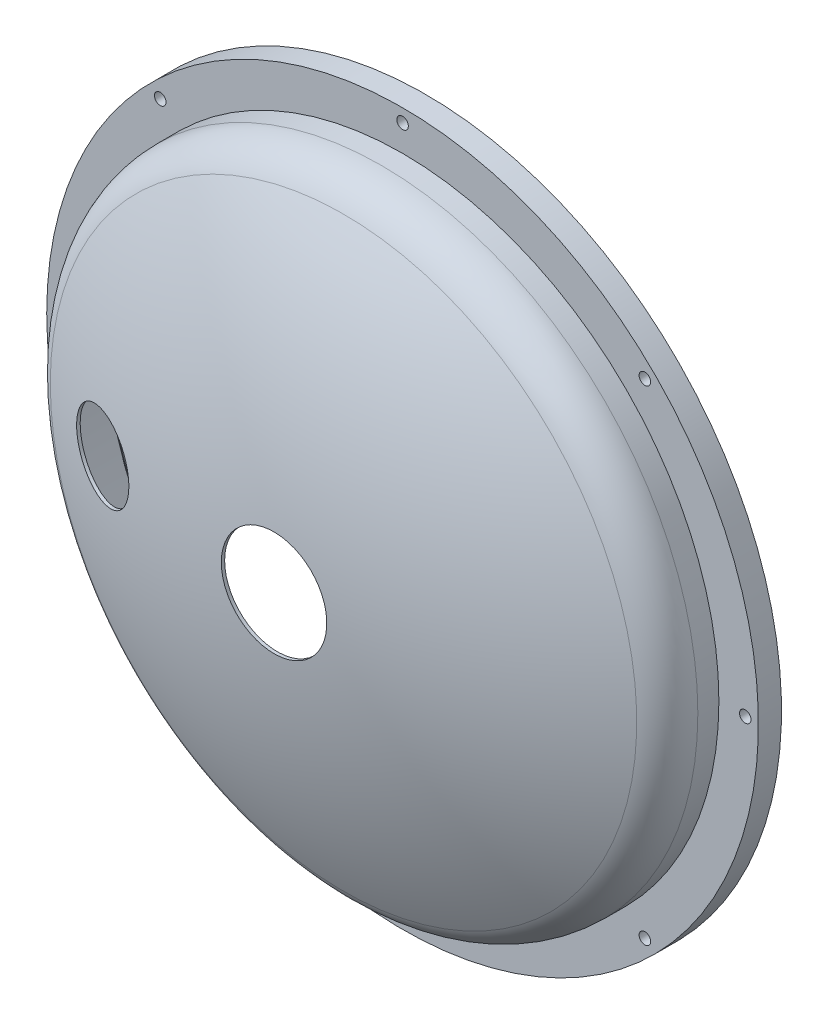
ISO-10303-21;
HEADER;
FILE_DESCRIPTION(('STEP AP214'),'2;1');
FILE_NAME('part.step','',(''),(''),'','','');
FILE_SCHEMA(('AUTOMOTIVE_DESIGN { 1 0 10303 214 1 1 1 1 }'));
ENDSEC;
DATA;
#1=APPLICATION_CONTEXT('core data for automotive mechanical design processes');
#2=APPLICATION_PROTOCOL_DEFINITION('international standard','automotive_design',2000,#1);
#3=PRODUCT_CONTEXT('',#1,'mechanical');
#4=PRODUCT('Part','Part','',(#3));
#5=PRODUCT_RELATED_PRODUCT_CATEGORY('part','',(#4));
#6=PRODUCT_DEFINITION_FORMATION('','',#4);
#7=PRODUCT_DEFINITION_CONTEXT('part definition',#1,'design');
#8=PRODUCT_DEFINITION('design','',#6,#7);
#9=PRODUCT_DEFINITION_SHAPE('','',#8);
#10=(LENGTH_UNIT() NAMED_UNIT(*) SI_UNIT(.MILLI.,.METRE.));
#11=(NAMED_UNIT(*) PLANE_ANGLE_UNIT() SI_UNIT($,.RADIAN.));
#12=(NAMED_UNIT(*) SI_UNIT($,.STERADIAN.) SOLID_ANGLE_UNIT());
#13=UNCERTAINTY_MEASURE_WITH_UNIT(LENGTH_MEASURE(1.E-05),#10,'distance_accuracy_value','');
#14=(GEOMETRIC_REPRESENTATION_CONTEXT(3) GLOBAL_UNCERTAINTY_ASSIGNED_CONTEXT((#13)) GLOBAL_UNIT_ASSIGNED_CONTEXT((#10,
#11,#12)) REPRESENTATION_CONTEXT('',''));
#15=CARTESIAN_POINT('',(0.,0.,0.));
#16=DIRECTION('',(0.,0.,1.));
#17=DIRECTION('',(1.,0.,0.));
#18=AXIS2_PLACEMENT_3D('',#15,#16,#17);
#19=CARTESIAN_POINT('',(609.6,0.,-247.65));
#20=DIRECTION('',(0.,0.,-1.));
#21=DIRECTION('',(-1.,0.,0.));
#22=AXIS2_PLACEMENT_3D('',#19,#20,#21);
#23=PLANE('',#22);
#24=CARTESIAN_POINT('',(0.,0.,-247.65));
#25=DIRECTION('',(0.,0.,-1.));
#26=DIRECTION('',(-1.,0.,0.));
#27=AXIS2_PLACEMENT_3D('',#24,#25,#26);
#28=CIRCLE('',#27,609.6);
#29=CARTESIAN_POINT('',(-609.6,0.,-247.65));
#30=VERTEX_POINT('',#29);
#31=EDGE_CURVE('E48',#30,#30,#28,.T.);
#32=ORIENTED_EDGE('',*,*,#31,.T.);
#33=EDGE_LOOP('',(#32));
#34=FACE_BOUND('',#33,.T.);
#35=CARTESIAN_POINT('',(0.,0.,-247.65));
#36=DIRECTION('',(0.,0.,-1.));
#37=DIRECTION('',(-1.,0.,0.));
#38=AXIS2_PLACEMENT_3D('',#35,#36,#37);
#39=CIRCLE('',#38,685.8);
#40=CARTESIAN_POINT('',(-685.8,0.,-247.65));
#41=VERTEX_POINT('',#40);
#42=EDGE_CURVE('E53',#41,#41,#39,.T.);
#43=ORIENTED_EDGE('',*,*,#42,.F.);
#44=EDGE_LOOP('',(#43));
#45=FACE_BOUND('',#44,.T.);
#46=CARTESIAN_POINT('',(660.4,0.,-247.65));
#47=DIRECTION('',(0.,0.,1.));
#48=DIRECTION('',(1.,0.,0.));
#49=AXIS2_PLACEMENT_3D('',#46,#47,#48);
#50=CIRCLE('',#49,11.1125);
#51=CARTESIAN_POINT('',(671.5125,0.,-247.65));
#52=VERTEX_POINT('',#51);
#53=EDGE_CURVE('E89',#52,#52,#50,.T.);
#54=ORIENTED_EDGE('',*,*,#53,.F.);
#55=EDGE_LOOP('',(#54));
#56=FACE_BOUND('',#55,.T.);
#57=CARTESIAN_POINT('',(466.973318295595,466.973318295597,-247.65));
#58=DIRECTION('',(0.,0.,1.));
#59=DIRECTION('',(1.,0.,0.));
#60=AXIS2_PLACEMENT_3D('',#57,#58,#59);
#61=CIRCLE('',#60,11.1125);
#62=CARTESIAN_POINT('',(478.085818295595,466.973318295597,-247.65));
#63=VERTEX_POINT('',#62);
#64=EDGE_CURVE('E95',#63,#63,#61,.T.);
#65=ORIENTED_EDGE('',*,*,#64,.F.);
#66=EDGE_LOOP('',(#65));
#67=FACE_BOUND('',#66,.T.);
#68=CARTESIAN_POINT('',(-2.30577427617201E-12,660.4,-247.65));
#69=DIRECTION('',(0.,0.,1.));
#70=DIRECTION('',(1.,0.,0.));
#71=AXIS2_PLACEMENT_3D('',#68,#69,#70);
#72=CIRCLE('',#71,11.1125);
#73=CARTESIAN_POINT('',(11.1124999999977,660.4,-247.65));
#74=VERTEX_POINT('',#73);
#75=EDGE_CURVE('E101',#74,#74,#72,.T.);
#76=ORIENTED_EDGE('',*,*,#75,.F.);
#77=EDGE_LOOP('',(#76));
#78=FACE_BOUND('',#77,.T.);
#79=CARTESIAN_POINT('',(-466.973318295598,466.973318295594,-247.65));
#80=DIRECTION('',(0.,0.,1.));
#81=DIRECTION('',(1.,0.,0.));
#82=AXIS2_PLACEMENT_3D('',#79,#80,#81);
#83=CIRCLE('',#82,11.1125);
#84=CARTESIAN_POINT('',(-455.860818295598,466.973318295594,-247.65));
#85=VERTEX_POINT('',#84);
#86=EDGE_CURVE('E107',#85,#85,#83,.T.);
#87=ORIENTED_EDGE('',*,*,#86,.F.);
#88=EDGE_LOOP('',(#87));
#89=FACE_BOUND('',#88,.T.);
#90=CARTESIAN_POINT('',(-660.4,0.,-247.65));
#91=DIRECTION('',(0.,0.,1.));
#92=DIRECTION('',(1.,0.,0.));
#93=AXIS2_PLACEMENT_3D('',#90,#91,#92);
#94=CIRCLE('',#93,11.1125);
#95=CARTESIAN_POINT('',(-649.2875,0.,-247.65));
#96=VERTEX_POINT('',#95);
#97=EDGE_CURVE('E113',#96,#96,#94,.T.);
#98=ORIENTED_EDGE('',*,*,#97,.F.);
#99=EDGE_LOOP('',(#98));
#100=FACE_BOUND('',#99,.T.);
#101=CARTESIAN_POINT('',(-466.973318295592,-466.9733182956,-247.65));
#102=DIRECTION('',(0.,0.,1.));
#103=DIRECTION('',(1.,0.,0.));
#104=AXIS2_PLACEMENT_3D('',#101,#102,#103);
#105=CIRCLE('',#104,11.1125);
#106=CARTESIAN_POINT('',(-455.860818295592,-466.9733182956,-247.65));
#107=VERTEX_POINT('',#106);
#108=EDGE_CURVE('E119',#107,#107,#105,.T.);
#109=ORIENTED_EDGE('',*,*,#108,.F.);
#110=EDGE_LOOP('',(#109));
#111=FACE_BOUND('',#110,.T.);
#112=CARTESIAN_POINT('',(6.91732282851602E-12,-660.4,-247.65));
#113=DIRECTION('',(0.,0.,1.));
#114=DIRECTION('',(1.,0.,0.));
#115=AXIS2_PLACEMENT_3D('',#112,#113,#114);
#116=CIRCLE('',#115,11.1125);
#117=CARTESIAN_POINT('',(11.1125000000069,-660.4,-247.65));
#118=VERTEX_POINT('',#117);
#119=EDGE_CURVE('E125',#118,#118,#116,.T.);
#120=ORIENTED_EDGE('',*,*,#119,.F.);
#121=EDGE_LOOP('',(#120));
#122=FACE_BOUND('',#121,.T.);
#123=CARTESIAN_POINT('',(466.973318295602,-466.97331829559,-247.65));
#124=DIRECTION('',(0.,0.,1.));
#125=DIRECTION('',(1.,0.,0.));
#126=AXIS2_PLACEMENT_3D('',#123,#124,#125);
#127=CIRCLE('',#126,11.1125);
#128=CARTESIAN_POINT('',(478.085818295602,-466.97331829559,-247.65));
#129=VERTEX_POINT('',#128);
#130=EDGE_CURVE('E131',#129,#129,#127,.T.);
#131=ORIENTED_EDGE('',*,*,#130,.F.);
#132=EDGE_LOOP('',(#131));
#133=FACE_BOUND('',#132,.T.);
#134=ADVANCED_FACE('F31',(#34,#45,#56,#67,#78,#89,#100,#111,#122,#133),#23,.F.);
#135=CARTESIAN_POINT('',(0.,0.,-1221.3313401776));
#136=DIRECTION('',(0.,0.,-1.));
#137=DIRECTION('',(1.,0.,0.));
#138=AXIS2_PLACEMENT_3D('',#135,#136,#137);
#139=SPHERICAL_SURFACE('',#138,1225.55);
#140=CARTESIAN_POINT('',(-447.898169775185,-53.5630319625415,-81.817832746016));
#141=CARTESIAN_POINT('',(-448.622080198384,-52.8305403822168,-82.0679425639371));
#142=CARTESIAN_POINT('',(-449.331912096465,-52.082586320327,-82.3132706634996));
#143=CARTESIAN_POINT('',(-450.722074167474,-50.556779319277,-82.7938796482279));
#144=CARTESIAN_POINT('',(-451.402408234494,-49.7789303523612,-83.0291618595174));
#145=CARTESIAN_POINT('',(-452.732430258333,-48.1942163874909,-83.4892642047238));
#146=CARTESIAN_POINT('',(-453.382112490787,-47.38734601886,-83.7140823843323));
#147=CARTESIAN_POINT('',(-454.649414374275,-45.7458635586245,-84.1527474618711));
#148=CARTESIAN_POINT('',(-455.267032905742,-44.9112504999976,-84.3665939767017));
#149=CARTESIAN_POINT('',(-456.469230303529,-43.2150999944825,-84.7829584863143));
#150=CARTESIAN_POINT('',(-457.053791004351,-42.3535481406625,-84.9854702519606));
#151=CARTESIAN_POINT('',(-458.188320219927,-40.6052042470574,-85.3786088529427));
#152=CARTESIAN_POINT('',(-458.738285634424,-39.7184099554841,-85.569234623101));
#153=CARTESIAN_POINT('',(-459.802307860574,-37.9211723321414,-85.9381266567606));
#154=CARTESIAN_POINT('',(-460.316369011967,-37.0107318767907,-86.1163944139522));
#155=CARTESIAN_POINT('',(-461.307559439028,-35.1674991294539,-86.4601978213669));
#156=CARTESIAN_POINT('',(-461.78468530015,-34.2347047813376,-86.6257322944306));
#157=CARTESIAN_POINT('',(-462.701595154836,-32.3469121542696,-86.943909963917));
#158=CARTESIAN_POINT('',(-463.141318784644,-31.3918810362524,-87.0965323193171));
#159=CARTESIAN_POINT('',(-463.981595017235,-29.4625958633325,-87.3882349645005));
#160=CARTESIAN_POINT('',(-464.382143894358,-28.488339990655,-87.5273139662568));
#161=CARTESIAN_POINT('',(-465.143044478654,-26.5224846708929,-87.7915584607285));
#162=CARTESIAN_POINT('',(-465.503399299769,-25.5308865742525,-87.916725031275));
#163=CARTESIAN_POINT('',(-466.183111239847,-23.5319596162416,-88.1528526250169));
#164=CARTESIAN_POINT('',(-466.502464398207,-22.52462924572,-88.2638122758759));
#165=CARTESIAN_POINT('',(-467.099250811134,-20.4965105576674,-88.4711929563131));
#166=CARTESIAN_POINT('',(-467.376697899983,-19.4757268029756,-88.5676187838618));
#167=CARTESIAN_POINT('',(-467.889135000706,-17.4221791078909,-88.7457339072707));
#168=CARTESIAN_POINT('',(-468.124120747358,-16.3894139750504,-88.827421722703));
#169=CARTESIAN_POINT('',(-468.550983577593,-14.3140586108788,-88.9758246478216));
#170=CARTESIAN_POINT('',(-468.742866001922,-13.2714696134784,-89.0425416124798));
#171=CARTESIAN_POINT('',(-469.08308662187,-11.1783315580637,-89.1608435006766));
#172=CARTESIAN_POINT('',(-469.231420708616,-10.1277817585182,-89.2124269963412));
#173=CARTESIAN_POINT('',(-469.602551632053,-7.03317177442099,-89.341494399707));
#174=CARTESIAN_POINT('',(-469.764877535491,-4.98058947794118,-89.3979548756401));
#175=CARTESIAN_POINT('',(-469.922835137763,-0.868561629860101,-89.452895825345));
#176=CARTESIAN_POINT('',(-469.918470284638,1.19088377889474,-89.4513774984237));
#177=CARTESIAN_POINT('',(-469.743167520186,5.30170069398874,-89.3904038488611));
#178=CARTESIAN_POINT('',(-469.572243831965,7.35307287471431,-89.3309534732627));
#179=CARTESIAN_POINT('',(-469.065483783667,11.4328193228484,-89.1547204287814));
#180=CARTESIAN_POINT('',(-468.729648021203,13.46119367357,-89.0379379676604));
#181=CARTESIAN_POINT('',(-467.902683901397,17.4495179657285,-88.7504382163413));
#182=CARTESIAN_POINT('',(-467.414014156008,19.4100401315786,-88.5805748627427));
#183=CARTESIAN_POINT('',(-466.284367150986,23.2812192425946,-88.1880216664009));
#184=CARTESIAN_POINT('',(-465.64339219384,25.1918769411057,-87.9653326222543));
#185=CARTESIAN_POINT('',(-464.214790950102,28.9507684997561,-87.4691847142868));
#186=CARTESIAN_POINT('',(-463.427160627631,30.7990006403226,-87.1957244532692));
#187=CARTESIAN_POINT('',(-461.712003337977,34.4212623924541,-86.6004868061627));
#188=CARTESIAN_POINT('',(-460.784473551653,36.1952905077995,-86.2787084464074));
#189=CARTESIAN_POINT('',(-458.775981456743,39.6952618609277,-85.5822620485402));
#190=CARTESIAN_POINT('',(-457.692171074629,41.4193751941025,-85.2066131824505));
#191=CARTESIAN_POINT('',(-455.395541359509,44.7685528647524,-84.4110433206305));
#192=CARTESIAN_POINT('',(-454.182720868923,46.3936163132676,-83.9911219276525));
#193=CARTESIAN_POINT('',(-451.637432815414,49.5356659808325,-83.110389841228));
#194=CARTESIAN_POINT('',(-450.304948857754,51.0526373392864,-82.6495735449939));
#195=CARTESIAN_POINT('',(-447.530446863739,53.9701381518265,-81.6906913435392));
#196=CARTESIAN_POINT('',(-446.088425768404,55.3706643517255,-81.1926243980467));
#197=CARTESIAN_POINT('',(-443.034448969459,58.1116062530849,-80.1385352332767));
#198=CARTESIAN_POINT('',(-441.417679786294,59.4460350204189,-79.5808854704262));
#199=CARTESIAN_POINT('',(-438.087289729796,61.9723927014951,-78.4330726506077));
#200=CARTESIAN_POINT('',(-436.373666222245,63.1643177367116,-77.8429087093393));
#201=CARTESIAN_POINT('',(-432.861386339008,65.4000014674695,-76.6342788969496));
#202=CARTESIAN_POINT('',(-431.062713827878,66.4437318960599,-76.0158076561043));
#203=CARTESIAN_POINT('',(-427.392808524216,68.3779011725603,-74.7549787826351));
#204=CARTESIAN_POINT('',(-425.521573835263,69.2683360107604,-74.1126205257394));
#205=CARTESIAN_POINT('',(-421.617278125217,70.9352362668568,-72.773514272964));
#206=CARTESIAN_POINT('',(-419.580907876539,71.7030966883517,-72.075692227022));
#207=CARTESIAN_POINT('',(-415.455294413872,73.0606841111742,-70.663250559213));
#208=CARTESIAN_POINT('',(-413.366049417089,73.650405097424,-69.9486303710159));
#209=CARTESIAN_POINT('',(-409.14842532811,74.6490678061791,-68.5073719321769));
#210=CARTESIAN_POINT('',(-407.020039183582,75.0579766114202,-67.7807315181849));
#211=CARTESIAN_POINT('',(-402.738559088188,75.6929871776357,-66.3204119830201));
#212=CARTESIAN_POINT('',(-400.585464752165,75.9190860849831,-65.5867327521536));
#213=CARTESIAN_POINT('',(-396.187951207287,76.1924045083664,-64.0896883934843));
#214=CARTESIAN_POINT('',(-393.943123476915,76.2326307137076,-63.3262375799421));
#215=CARTESIAN_POINT('',(-389.457625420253,76.1148864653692,-61.8022551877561));
#216=CARTESIAN_POINT('',(-387.216955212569,75.9569104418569,-61.0417236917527));
#217=CARTESIAN_POINT('',(-382.755318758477,75.4433351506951,-59.5288239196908));
#218=CARTESIAN_POINT('',(-380.534354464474,75.0877165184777,-58.7764564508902));
#219=CARTESIAN_POINT('',(-376.128202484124,74.1803966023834,-57.2852664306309));
#220=CARTESIAN_POINT('',(-373.943014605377,73.6286963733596,-56.546443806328));
#221=CARTESIAN_POINT('',(-369.612975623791,72.3283621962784,-55.0837964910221));
#222=CARTESIAN_POINT('',(-367.46839700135,71.5787080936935,-54.3600710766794));
#223=CARTESIAN_POINT('',(-363.247781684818,69.8875578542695,-52.937033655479));
#224=CARTESIAN_POINT('',(-361.171745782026,68.9460595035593,-52.237721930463));
#225=CARTESIAN_POINT('',(-357.104797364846,66.8762792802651,-50.8689514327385));
#226=CARTESIAN_POINT('',(-355.113879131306,65.7480099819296,-50.1994906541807));
#227=CARTESIAN_POINT('',(-351.233514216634,63.3110267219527,-48.8957520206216));
#228=CARTESIAN_POINT('',(-349.344064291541,62.0023185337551,-48.26147304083));
#229=CARTESIAN_POINT('',(-345.737276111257,59.2537317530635,-47.0516135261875));
#230=CARTESIAN_POINT('',(-344.016496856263,57.8188892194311,-46.4748505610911));
#231=CARTESIAN_POINT('',(-340.700648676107,54.7954588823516,-45.3642189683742));
#232=CARTESIAN_POINT('',(-339.105578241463,53.2068729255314,-44.8303498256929));
#233=CARTESIAN_POINT('',(-336.055915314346,49.8866655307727,-43.8102639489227));
#234=CARTESIAN_POINT('',(-334.601290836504,48.15507682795,-43.3240363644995));
#235=CARTESIAN_POINT('',(-331.845962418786,44.5605801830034,-42.4035418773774));
#236=CARTESIAN_POINT('',(-330.545251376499,42.6976783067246,-41.9692725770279));
#237=CARTESIAN_POINT('',(-328.172755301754,38.9522940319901,-41.177547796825));
#238=CARTESIAN_POINT('',(-327.09268219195,37.0756469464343,-40.8173056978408));
#239=CARTESIAN_POINT('',(-325.092926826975,33.2296051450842,-40.150577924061));
#240=CARTESIAN_POINT('',(-324.173239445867,31.2602133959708,-39.84409053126));
#241=CARTESIAN_POINT('',(-322.50342314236,27.2436523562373,-39.2877984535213));
#242=CARTESIAN_POINT('',(-321.753251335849,25.1965028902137,-39.0379794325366));
#243=CARTESIAN_POINT('',(-320.429741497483,21.0396391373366,-38.5973368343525));
#244=CARTESIAN_POINT('',(-319.856397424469,18.9299269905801,-38.4065112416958));
#245=CARTESIAN_POINT('',(-318.915700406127,14.7675173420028,-38.0934717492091));
#246=CARTESIAN_POINT('',(-318.539749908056,12.716973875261,-37.9683938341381));
#247=CARTESIAN_POINT('',(-317.956973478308,8.5893891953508,-37.7745223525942));
#248=CARTESIAN_POINT('',(-317.750141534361,6.51234892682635,-37.7057267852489));
#249=CARTESIAN_POINT('',(-317.507613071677,2.34751374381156,-37.6250592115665));
#250=CARTESIAN_POINT('',(-317.471891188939,0.259720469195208,-37.6131787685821));
#251=CARTESIAN_POINT('',(-317.5718619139,-3.91129977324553,-37.6464291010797));
#252=CARTESIAN_POINT('',(-317.707553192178,-5.99452677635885,-37.6915594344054));
#253=CARTESIAN_POINT('',(-318.143754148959,-10.0913741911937,-37.8366568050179));
#254=CARTESIAN_POINT('',(-318.440257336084,-12.1054700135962,-37.9352908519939));
#255=CARTESIAN_POINT('',(-319.192603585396,-16.1002750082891,-38.1856128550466));
#256=CARTESIAN_POINT('',(-319.648443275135,-18.0809848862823,-38.3372996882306));
#257=CARTESIAN_POINT('',(-320.715342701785,-21.9953393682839,-38.6924167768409));
#258=CARTESIAN_POINT('',(-321.326400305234,-23.9289846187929,-38.8958463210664));
#259=CARTESIAN_POINT('',(-322.698350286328,-27.7362634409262,-39.3527347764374));
#260=CARTESIAN_POINT('',(-323.459244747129,-29.6098961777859,-39.6061943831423));
#261=CARTESIAN_POINT('',(-325.132075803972,-33.3020332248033,-40.1636406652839));
#262=CARTESIAN_POINT('',(-326.045349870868,-35.1198637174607,-40.4680748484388));
#263=CARTESIAN_POINT('',(-328.01014508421,-38.6703996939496,-41.1233197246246));
#264=CARTESIAN_POINT('',(-329.061666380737,-40.4031050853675,-41.4741304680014));
#265=CARTESIAN_POINT('',(-331.294502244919,-43.7730489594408,-42.219428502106));
#266=CARTESIAN_POINT('',(-332.475829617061,-45.4102779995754,-42.6139201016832));
#267=CARTESIAN_POINT('',(-334.958962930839,-48.579662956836,-43.4435963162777));
#268=CARTESIAN_POINT('',(-336.260771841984,-50.1118162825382,-43.8787819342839));
#269=CARTESIAN_POINT('',(-339.025694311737,-53.1176421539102,-44.8036344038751));
#270=CARTESIAN_POINT('',(-340.493009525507,-54.5870119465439,-45.2947266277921));
#271=CARTESIAN_POINT('',(-343.535474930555,-57.3955303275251,-46.3136896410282));
#272=CARTESIAN_POINT('',(-345.110627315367,-58.7346762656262,-46.841561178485));
#273=CARTESIAN_POINT('',(-348.357459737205,-61.275972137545,-47.9304346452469));
#274=CARTESIAN_POINT('',(-350.029155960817,-62.4780989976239,-48.4914421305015));
#275=CARTESIAN_POINT('',(-353.457111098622,-64.7392167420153,-49.6427063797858));
#276=CARTESIAN_POINT('',(-355.213372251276,-65.7982038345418,-50.2329639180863));
#277=CARTESIAN_POINT('',(-358.889332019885,-67.8179520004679,-51.4693852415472));
#278=CARTESIAN_POINT('',(-360.812804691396,-68.771042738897,-52.1168668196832));
#279=CARTESIAN_POINT('',(-364.726398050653,-70.5092565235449,-53.4354024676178));
#280=CARTESIAN_POINT('',(-366.716520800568,-71.2943743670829,-54.1064572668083));
#281=CARTESIAN_POINT('',(-370.750082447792,-72.6931802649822,-55.4677542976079));
#282=CARTESIAN_POINT('',(-372.793529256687,-73.3068427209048,-56.1579993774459));
#283=CARTESIAN_POINT('',(-376.919928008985,-74.3599595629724,-57.5531019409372));
#284=CARTESIAN_POINT('',(-379.002880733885,-74.7994104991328,-58.2579597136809));
#285=CARTESIAN_POINT('',(-383.28801438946,-75.5179262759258,-59.7093622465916));
#286=CARTESIAN_POINT('',(-385.491382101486,-75.7890015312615,-60.4563681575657));
#287=CARTESIAN_POINT('',(-389.911383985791,-76.1380414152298,-61.9563398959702));
#288=CARTESIAN_POINT('',(-392.128018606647,-76.215999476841,-62.7093059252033));
#289=CARTESIAN_POINT('',(-396.560231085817,-76.1785555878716,-64.2163525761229));
#290=CARTESIAN_POINT('',(-398.775808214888,-76.063079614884,-64.9704335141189));
#291=CARTESIAN_POINT('',(-403.189898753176,-75.6392611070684,-66.4742530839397));
#292=CARTESIAN_POINT('',(-405.388412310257,-75.3309202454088,-67.2239917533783));
#293=CARTESIAN_POINT('',(-409.797502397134,-74.5146834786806,-68.7290337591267));
#294=CARTESIAN_POINT('',(-412.007422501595,-74.0028750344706,-69.4841426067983));
#295=CARTESIAN_POINT('',(-416.377868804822,-72.7825666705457,-70.9789258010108));
#296=CARTESIAN_POINT('',(-418.538391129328,-72.0740513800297,-71.7185989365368));
#297=CARTESIAN_POINT('',(-422.791463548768,-70.4648232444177,-73.1760437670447));
#298=CARTESIAN_POINT('',(-424.884081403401,-69.5643092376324,-73.8938372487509));
#299=CARTESIAN_POINT('',(-428.987131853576,-67.5755383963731,-75.3025095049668));
#300=CARTESIAN_POINT('',(-430.99758519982,-66.4873293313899,-75.9933950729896));
#301=CARTESIAN_POINT('',(-434.311330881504,-64.4953576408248,-77.1331373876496));
#302=CARTESIAN_POINT('',(-435.640453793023,-63.6391613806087,-77.5905651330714));
#303=CARTESIAN_POINT('',(-437.594946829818,-62.2920510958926,-78.2636074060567));
#304=CARTESIAN_POINT('',(-438.239865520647,-61.8325819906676,-78.4857553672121));
#305=CARTESIAN_POINT('',(-439.516155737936,-60.8929223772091,-78.925510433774));
#306=CARTESIAN_POINT('',(-440.147525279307,-60.4127288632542,-79.1431168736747));
#307=CARTESIAN_POINT('',(-442.020079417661,-58.9417446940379,-79.7886878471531));
#308=CARTESIAN_POINT('',(-443.239936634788,-57.9203939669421,-80.2094822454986));
#309=CARTESIAN_POINT('',(-445.617224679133,-55.7994566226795,-81.0299685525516));
#310=CARTESIAN_POINT('',(-446.774652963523,-54.6998668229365,-81.4296596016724));
#311=CARTESIAN_POINT('',(-447.898169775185,-53.5630319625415,-81.817832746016));
#312=B_SPLINE_CURVE_WITH_KNOTS('',3,(#140,#141,#142,#143,#144,#145,#146,#147,#148,#149,#150,
#151,#152,#153,#154,#155,#156,#157,#158,#159,#160,#161,#162,#163,#164,#165,#166,#167,#168,#169,
#170,#171,#172,#173,#174,#175,#176,#177,#178,#179,#180,#181,#182,#183,#184,#185,#186,#187,#188,
#189,#190,#191,#192,#193,#194,#195,#196,#197,#198,#199,#200,#201,#202,#203,#204,#205,#206,#207,
#208,#209,#210,#211,#212,#213,#214,#215,#216,#217,#218,#219,#220,#221,#222,#223,#224,#225,#226,
#227,#228,#229,#230,#231,#232,#233,#234,#235,#236,#237,#238,#239,#240,#241,#242,#243,#244,#245,
#246,#247,#248,#249,#250,#251,#252,#253,#254,#255,#256,#257,#258,#259,#260,#261,#262,#263,#264,
#265,#266,#267,#268,#269,#270,#271,#272,#273,#274,#275,#276,#277,#278,#279,#280,#281,#282,#283,
#284,#285,#286,#287,#288,#289,#290,#291,#292,#293,#294,#295,#296,#297,#298,#299,#300,#301,#302,
#303,#304,#305,#306,#307,#308,#309,#310,#311),.UNSPECIFIED.,.T.,.F.,(4,2,2,2,2,2,2,2,2,2,2,2,2,
2,2,2,2,2,2,2,2,2,2,2,2,2,2,2,2,2,2,2,2,2,2,2,2,2,2,2,2,2,2,2,2,2,2,2,2,2,2,2,2,2,2,2,2,2,2,2,2,
2,2,2,2,2,2,2,2,2,2,2,2,2,2,2,2,2,2,2,2,2,2,2,2,4),(0.,3.17903557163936,6.35765018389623,
9.53685608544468,12.7161729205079,15.8972201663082,19.0785520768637,22.25949879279,
25.4407392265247,28.6270201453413,31.8136037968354,34.9999404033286,38.1865845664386,
41.3721744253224,44.5580840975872,47.7435987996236,50.9294139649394,57.1004913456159,
63.2714410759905,69.441863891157,75.6122643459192,81.6881078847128,87.7638595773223,
93.8397784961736,99.9158198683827,106.121322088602,112.326879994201,118.533289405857,
124.739872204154,131.240358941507,137.741022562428,144.242924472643,150.744996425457,
157.593653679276,164.442542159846,171.292676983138,178.142918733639,185.24890337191,
192.355087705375,199.461968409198,206.568810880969,213.713018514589,220.85730859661,
228.001117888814,235.144698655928,242.07659744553,249.008412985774,255.938646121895,
262.868559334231,269.44533477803,276.021899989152,282.596799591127,289.171474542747,
295.429215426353,301.686733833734,307.94332464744,314.199866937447,320.307249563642,
326.414502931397,332.521672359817,338.628926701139,344.79291554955,350.956911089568,
357.121515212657,363.286271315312,369.680606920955,376.075072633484,382.470613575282,
388.866323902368,395.58530552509,402.30449522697,409.024687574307,415.745012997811,
422.763792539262,429.782810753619,436.804515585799,443.826159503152,450.989916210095,
458.154232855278,465.311165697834,472.466279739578,477.40086021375,479.867778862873,
482.335056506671,487.268753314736,492.202650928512),.UNSPECIFIED.);
#313=CARTESIAN_POINT('',(-447.898169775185,-53.5630319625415,-81.817832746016));
#314=VERTEX_POINT('',#313);
#315=EDGE_CURVE('E134',#314,#314,#312,.T.);
#316=ORIENTED_EDGE('',*,*,#315,.T.);
#317=EDGE_LOOP('',(#316));
#318=FACE_BOUND('',#317,.T.);
#319=CARTESIAN_POINT('',(0.,0.,-133.848856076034));
#320=DIRECTION('',(0.,0.,-1.));
#321=DIRECTION('',(-1.,0.,0.));
#322=AXIS2_PLACEMENT_3D('',#319,#320,#321);
#323=CIRCLE('',#322,565.114722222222);
#324=CARTESIAN_POINT('',(-565.114722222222,0.,-133.848856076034));
#325=VERTEX_POINT('',#324);
#326=EDGE_CURVE('E10',#325,#325,#323,.T.);
#327=ORIENTED_EDGE('',*,*,#326,.F.);
#328=EDGE_LOOP('',(#327));
#329=FACE_BOUND('',#328,.T.);
#330=CARTESIAN_POINT('',(0.,0.,0.));
#331=DIRECTION('',(0.,0.,-1.));
#332=DIRECTION('',(-1.,0.,0.));
#333=AXIS2_PLACEMENT_3D('',#330,#331,#332);
#334=CIRCLE('',#333,101.6);
#335=CARTESIAN_POINT('',(-101.6,0.,0.));
#336=VERTEX_POINT('',#335);
#337=EDGE_CURVE('E83',#336,#336,#334,.T.);
#338=ORIENTED_EDGE('',*,*,#337,.T.);
#339=EDGE_LOOP('',(#338));
#340=FACE_BOUND('',#339,.T.);
#341=ADVANCED_FACE('F33',(#318,#329,#340),#139,.T.);
#342=CARTESIAN_POINT('',(0.,0.,-207.098971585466));
#343=DIRECTION('',(0.,0.,-1.));
#344=DIRECTION('',(-1.,0.,0.));
#345=AXIS2_PLACEMENT_3D('',#342,#343,#344);
#346=TOROIDAL_SURFACE('',#345,527.05,82.55);
#347=CARTESIAN_POINT('',(0.,0.,-207.098971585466));
#348=DIRECTION('',(0.,0.,-1.));
#349=DIRECTION('',(-1.,0.,0.));
#350=AXIS2_PLACEMENT_3D('',#347,#348,#349);
#351=CIRCLE('',#350,609.6);
#352=CARTESIAN_POINT('',(-609.6,0.,-207.098971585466));
#353=VERTEX_POINT('',#352);
#354=EDGE_CURVE('E44',#353,#353,#351,.T.);
#355=ORIENTED_EDGE('',*,*,#354,.F.);
#356=EDGE_LOOP('',(#355));
#357=FACE_BOUND('',#356,.T.);
#358=ORIENTED_EDGE('',*,*,#326,.T.);
#359=EDGE_LOOP('',(#358));
#360=FACE_BOUND('',#359,.T.);
#361=ADVANCED_FACE('F221',(#357,#360),#346,.T.);
#362=CARTESIAN_POINT('',(0.,0.,-88.99));
#363=DIRECTION('',(0.,0.,-1.));
#364=DIRECTION('',(-1.,0.,0.));
#365=AXIS2_PLACEMENT_3D('',#362,#363,#364);
#366=CYLINDRICAL_SURFACE('',#365,609.6);
#367=ORIENTED_EDGE('',*,*,#31,.F.);
#368=EDGE_LOOP('',(#367));
#369=FACE_BOUND('',#368,.T.);
#370=ORIENTED_EDGE('',*,*,#354,.T.);
#371=EDGE_LOOP('',(#370));
#372=FACE_BOUND('',#371,.T.);
#373=ADVANCED_FACE('F215',(#369,#372),#366,.T.);
#374=CARTESIAN_POINT('',(0.,0.,-88.99));
#375=DIRECTION('',(0.,0.,-1.));
#376=DIRECTION('',(-1.,0.,0.));
#377=AXIS2_PLACEMENT_3D('',#374,#375,#376);
#378=CYLINDRICAL_SURFACE('',#377,685.8);
#379=CARTESIAN_POINT('',(0.,0.,-292.1));
#380=DIRECTION('',(0.,0.,-1.));
#381=DIRECTION('',(-1.,0.,0.));
#382=AXIS2_PLACEMENT_3D('',#379,#380,#381);
#383=CIRCLE('',#382,685.8);
#384=CARTESIAN_POINT('',(-685.8,0.,-292.1));
#385=VERTEX_POINT('',#384);
#386=EDGE_CURVE('E56',#385,#385,#383,.T.);
#387=ORIENTED_EDGE('',*,*,#386,.F.);
#388=EDGE_LOOP('',(#387));
#389=FACE_BOUND('',#388,.T.);
#390=ORIENTED_EDGE('',*,*,#42,.T.);
#391=EDGE_LOOP('',(#390));
#392=FACE_BOUND('',#391,.T.);
#393=ADVANCED_FACE('F211',(#389,#392),#378,.T.);
#394=CARTESIAN_POINT('',(685.8,0.,-292.1));
#395=DIRECTION('',(0.,0.,1.));
#396=DIRECTION('',(1.,0.,0.));
#397=AXIS2_PLACEMENT_3D('',#394,#395,#396);
#398=PLANE('',#397);
#399=CARTESIAN_POINT('',(466.973318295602,-466.97331829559,-292.1));
#400=DIRECTION('',(0.,0.,1.));
#401=DIRECTION('',(1.,0.,0.));
#402=AXIS2_PLACEMENT_3D('',#399,#400,#401);
#403=CIRCLE('',#402,11.1125);
#404=CARTESIAN_POINT('',(478.085818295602,-466.97331829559,-292.1));
#405=VERTEX_POINT('',#404);
#406=EDGE_CURVE('E128',#405,#405,#403,.T.);
#407=ORIENTED_EDGE('',*,*,#406,.T.);
#408=EDGE_LOOP('',(#407));
#409=FACE_BOUND('',#408,.T.);
#410=CARTESIAN_POINT('',(6.91732282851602E-12,-660.4,-292.1));
#411=DIRECTION('',(0.,0.,1.));
#412=DIRECTION('',(1.,0.,0.));
#413=AXIS2_PLACEMENT_3D('',#410,#411,#412);
#414=CIRCLE('',#413,11.1125);
#415=CARTESIAN_POINT('',(11.1125000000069,-660.4,-292.1));
#416=VERTEX_POINT('',#415);
#417=EDGE_CURVE('E122',#416,#416,#414,.T.);
#418=ORIENTED_EDGE('',*,*,#417,.T.);
#419=EDGE_LOOP('',(#418));
#420=FACE_BOUND('',#419,.T.);
#421=CARTESIAN_POINT('',(-466.973318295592,-466.9733182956,-292.1));
#422=DIRECTION('',(0.,0.,1.));
#423=DIRECTION('',(1.,0.,0.));
#424=AXIS2_PLACEMENT_3D('',#421,#422,#423);
#425=CIRCLE('',#424,11.1125);
#426=CARTESIAN_POINT('',(-455.860818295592,-466.9733182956,-292.1));
#427=VERTEX_POINT('',#426);
#428=EDGE_CURVE('E116',#427,#427,#425,.T.);
#429=ORIENTED_EDGE('',*,*,#428,.T.);
#430=EDGE_LOOP('',(#429));
#431=FACE_BOUND('',#430,.T.);
#432=CARTESIAN_POINT('',(-660.4,0.,-292.1));
#433=DIRECTION('',(0.,0.,1.));
#434=DIRECTION('',(1.,0.,0.));
#435=AXIS2_PLACEMENT_3D('',#432,#433,#434);
#436=CIRCLE('',#435,11.1125);
#437=CARTESIAN_POINT('',(-649.2875,0.,-292.1));
#438=VERTEX_POINT('',#437);
#439=EDGE_CURVE('E110',#438,#438,#436,.T.);
#440=ORIENTED_EDGE('',*,*,#439,.T.);
#441=EDGE_LOOP('',(#440));
#442=FACE_BOUND('',#441,.T.);
#443=CARTESIAN_POINT('',(-466.973318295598,466.973318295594,-292.1));
#444=DIRECTION('',(0.,0.,1.));
#445=DIRECTION('',(1.,0.,0.));
#446=AXIS2_PLACEMENT_3D('',#443,#444,#445);
#447=CIRCLE('',#446,11.1125);
#448=CARTESIAN_POINT('',(-455.860818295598,466.973318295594,-292.1));
#449=VERTEX_POINT('',#448);
#450=EDGE_CURVE('E104',#449,#449,#447,.T.);
#451=ORIENTED_EDGE('',*,*,#450,.T.);
#452=EDGE_LOOP('',(#451));
#453=FACE_BOUND('',#452,.T.);
#454=CARTESIAN_POINT('',(-2.30577427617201E-12,660.4,-292.1));
#455=DIRECTION('',(0.,0.,1.));
#456=DIRECTION('',(1.,0.,0.));
#457=AXIS2_PLACEMENT_3D('',#454,#455,#456);
#458=CIRCLE('',#457,11.1125);
#459=CARTESIAN_POINT('',(11.1124999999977,660.4,-292.1));
#460=VERTEX_POINT('',#459);
#461=EDGE_CURVE('E98',#460,#460,#458,.T.);
#462=ORIENTED_EDGE('',*,*,#461,.T.);
#463=EDGE_LOOP('',(#462));
#464=FACE_BOUND('',#463,.T.);
#465=CARTESIAN_POINT('',(466.973318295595,466.973318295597,-292.1));
#466=DIRECTION('',(0.,0.,1.));
#467=DIRECTION('',(1.,0.,0.));
#468=AXIS2_PLACEMENT_3D('',#465,#466,#467);
#469=CIRCLE('',#468,11.1125);
#470=CARTESIAN_POINT('',(478.085818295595,466.973318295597,-292.1));
#471=VERTEX_POINT('',#470);
#472=EDGE_CURVE('E92',#471,#471,#469,.T.);
#473=ORIENTED_EDGE('',*,*,#472,.T.);
#474=EDGE_LOOP('',(#473));
#475=FACE_BOUND('',#474,.T.);
#476=CARTESIAN_POINT('',(660.4,0.,-292.1));
#477=DIRECTION('',(0.,0.,1.));
#478=DIRECTION('',(1.,0.,0.));
#479=AXIS2_PLACEMENT_3D('',#476,#477,#478);
#480=CIRCLE('',#479,11.1125);
#481=CARTESIAN_POINT('',(671.5125,0.,-292.1));
#482=VERTEX_POINT('',#481);
#483=EDGE_CURVE('E86',#482,#482,#480,.T.);
#484=ORIENTED_EDGE('',*,*,#483,.T.);
#485=EDGE_LOOP('',(#484));
#486=FACE_BOUND('',#485,.T.);
#487=CARTESIAN_POINT('',(0.,0.,-292.1));
#488=DIRECTION('',(0.,0.,-1.));
#489=DIRECTION('',(-1.,0.,0.));
#490=AXIS2_PLACEMENT_3D('',#487,#488,#489);
#491=CIRCLE('',#490,642.9375);
#492=CARTESIAN_POINT('',(-642.9375,0.,-292.1));
#493=VERTEX_POINT('',#492);
#494=EDGE_CURVE('E59',#493,#493,#491,.T.);
#495=ORIENTED_EDGE('',*,*,#494,.F.);
#496=EDGE_LOOP('',(#495));
#497=FACE_BOUND('',#496,.T.);
#498=ORIENTED_EDGE('',*,*,#386,.T.);
#499=EDGE_LOOP('',(#498));
#500=FACE_BOUND('',#499,.T.);
#501=ADVANCED_FACE('F207',(#409,#420,#431,#442,#453,#464,#475,#486,#497,#500),#398,.F.);
#502=CARTESIAN_POINT('',(0.,0.,-88.99));
#503=DIRECTION('',(0.,0.,-1.));
#504=DIRECTION('',(-1.,0.,0.));
#505=AXIS2_PLACEMENT_3D('',#502,#503,#504);
#506=CYLINDRICAL_SURFACE('',#505,642.9375);
#507=CARTESIAN_POINT('',(0.,0.,-287.3375));
#508=DIRECTION('',(0.,0.,-1.));
#509=DIRECTION('',(-1.,0.,0.));
#510=AXIS2_PLACEMENT_3D('',#507,#508,#509);
#511=CIRCLE('',#510,642.9375);
#512=CARTESIAN_POINT('',(-642.9375,0.,-287.3375));
#513=VERTEX_POINT('',#512);
#514=EDGE_CURVE('E62',#513,#513,#511,.T.);
#515=ORIENTED_EDGE('',*,*,#514,.F.);
#516=EDGE_LOOP('',(#515));
#517=FACE_BOUND('',#516,.T.);
#518=ORIENTED_EDGE('',*,*,#494,.T.);
#519=EDGE_LOOP('',(#518));
#520=FACE_BOUND('',#519,.T.);
#521=ADVANCED_FACE('F203',(#517,#520),#506,.F.);
#522=CARTESIAN_POINT('',(642.9375,0.,-287.3375));
#523=DIRECTION('',(0.,0.,1.));
#524=DIRECTION('',(1.,0.,0.));
#525=AXIS2_PLACEMENT_3D('',#522,#523,#524);
#526=PLANE('',#525);
#527=CARTESIAN_POINT('',(0.,0.,-287.3375));
#528=DIRECTION('',(0.,0.,-1.));
#529=DIRECTION('',(-1.,0.,0.));
#530=AXIS2_PLACEMENT_3D('',#527,#528,#529);
#531=CIRCLE('',#530,609.6);
#532=CARTESIAN_POINT('',(-609.6,0.,-287.3375));
#533=VERTEX_POINT('',#532);
#534=EDGE_CURVE('E65',#533,#533,#531,.T.);
#535=ORIENTED_EDGE('',*,*,#534,.F.);
#536=EDGE_LOOP('',(#535));
#537=FACE_BOUND('',#536,.T.);
#538=ORIENTED_EDGE('',*,*,#514,.T.);
#539=EDGE_LOOP('',(#538));
#540=FACE_BOUND('',#539,.T.);
#541=ADVANCED_FACE('F199',(#537,#540),#526,.F.);
#542=CARTESIAN_POINT('',(0.,0.,-88.99));
#543=DIRECTION('',(0.,0.,-1.));
#544=DIRECTION('',(-1.,0.,0.));
#545=AXIS2_PLACEMENT_3D('',#542,#543,#544);
#546=CYLINDRICAL_SURFACE('',#545,609.6);
#547=CARTESIAN_POINT('',(0.,0.,-284.1625));
#548=DIRECTION('',(0.,0.,-1.));
#549=DIRECTION('',(-1.,0.,0.));
#550=AXIS2_PLACEMENT_3D('',#547,#548,#549);
#551=CIRCLE('',#550,609.6);
#552=CARTESIAN_POINT('',(-609.6,0.,-284.1625));
#553=VERTEX_POINT('',#552);
#554=EDGE_CURVE('E68',#553,#553,#551,.T.);
#555=ORIENTED_EDGE('',*,*,#554,.F.);
#556=EDGE_LOOP('',(#555));
#557=FACE_BOUND('',#556,.T.);
#558=ORIENTED_EDGE('',*,*,#534,.T.);
#559=EDGE_LOOP('',(#558));
#560=FACE_BOUND('',#559,.T.);
#561=ADVANCED_FACE('F195',(#557,#560),#546,.F.);
#562=CARTESIAN_POINT('',(0.,0.,-284.1625));
#563=DIRECTION('',(0.,0.,-1.));
#564=DIRECTION('',(-1.,0.,0.));
#565=AXIS2_PLACEMENT_3D('',#562,#563,#564);
#566=CONICAL_SURFACE('',#565,609.6,0.785398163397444);
#567=CARTESIAN_POINT('',(0.,0.,-277.8125));
#568=DIRECTION('',(0.,0.,-1.));
#569=DIRECTION('',(-1.,0.,0.));
#570=AXIS2_PLACEMENT_3D('',#567,#568,#569);
#571=CIRCLE('',#570,603.25);
#572=CARTESIAN_POINT('',(-603.25,0.,-277.8125));
#573=VERTEX_POINT('',#572);
#574=EDGE_CURVE('E71',#573,#573,#571,.T.);
#575=ORIENTED_EDGE('',*,*,#574,.F.);
#576=EDGE_LOOP('',(#575));
#577=FACE_BOUND('',#576,.T.);
#578=ORIENTED_EDGE('',*,*,#554,.T.);
#579=EDGE_LOOP('',(#578));
#580=FACE_BOUND('',#579,.T.);
#581=ADVANCED_FACE('F191',(#577,#580),#566,.F.);
#582=CARTESIAN_POINT('',(0.,0.,-88.99));
#583=DIRECTION('',(0.,0.,-1.));
#584=DIRECTION('',(-1.,0.,0.));
#585=AXIS2_PLACEMENT_3D('',#582,#583,#584);
#586=CYLINDRICAL_SURFACE('',#585,603.25);
#587=CARTESIAN_POINT('',(0.,0.,-207.098971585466));
#588=DIRECTION('',(0.,0.,-1.));
#589=DIRECTION('',(-1.,0.,0.));
#590=AXIS2_PLACEMENT_3D('',#587,#588,#589);
#591=CIRCLE('',#590,603.25);
#592=CARTESIAN_POINT('',(-603.25,0.,-207.098971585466));
#593=VERTEX_POINT('',#592);
#594=EDGE_CURVE('E74',#593,#593,#591,.T.);
#595=ORIENTED_EDGE('',*,*,#594,.F.);
#596=EDGE_LOOP('',(#595));
#597=FACE_BOUND('',#596,.T.);
#598=ORIENTED_EDGE('',*,*,#574,.T.);
#599=EDGE_LOOP('',(#598));
#600=FACE_BOUND('',#599,.T.);
#601=ADVANCED_FACE('F187',(#597,#600),#586,.F.);
#602=CARTESIAN_POINT('',(0.,0.,-207.098971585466));
#603=DIRECTION('',(0.,0.,-1.));
#604=DIRECTION('',(-1.,0.,0.));
#605=AXIS2_PLACEMENT_3D('',#602,#603,#604);
#606=TOROIDAL_SURFACE('',#605,527.05,76.1999999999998);
#607=CARTESIAN_POINT('',(0.,0.,-139.483480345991));
#608=DIRECTION('',(0.,0.,-1.));
#609=DIRECTION('',(-1.,0.,0.));
#610=AXIS2_PLACEMENT_3D('',#607,#608,#609);
#611=CIRCLE('',#610,562.186666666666);
#612=CARTESIAN_POINT('',(-562.186666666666,0.,-139.483480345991));
#613=VERTEX_POINT('',#612);
#614=EDGE_CURVE('E77',#613,#613,#611,.T.);
#615=ORIENTED_EDGE('',*,*,#614,.F.);
#616=EDGE_LOOP('',(#615));
#617=FACE_BOUND('',#616,.T.);
#618=ORIENTED_EDGE('',*,*,#594,.T.);
#619=EDGE_LOOP('',(#618));
#620=FACE_BOUND('',#619,.T.);
#621=ADVANCED_FACE('F183',(#617,#620),#606,.F.);
#622=CARTESIAN_POINT('',(0.,0.,-1221.3313401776));
#623=DIRECTION('',(0.,0.,-1.));
#624=DIRECTION('',(1.,0.,0.));
#625=AXIS2_PLACEMENT_3D('',#622,#623,#624);
#626=SPHERICAL_SURFACE('',#625,1219.2);
#627=CARTESIAN_POINT('',(-447.749455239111,-53.7130932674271,-88.598375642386));
#628=CARTESIAN_POINT('',(-446.964524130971,-54.5029396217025,-88.3255599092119));
#629=CARTESIAN_POINT('',(-446.163239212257,-55.2746090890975,-88.0471587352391));
#630=CARTESIAN_POINT('',(-444.529687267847,-56.7804280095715,-87.4798090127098));
#631=CARTESIAN_POINT('',(-443.697418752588,-57.5145756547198,-87.1908599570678));
#632=CARTESIAN_POINT('',(-442.003449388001,-58.9444271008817,-86.6029760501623));
#633=CARTESIAN_POINT('',(-441.141740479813,-59.6401202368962,-86.3040384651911));
#634=CARTESIAN_POINT('',(-439.390779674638,-60.9919388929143,-85.6968557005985));
#635=CARTESIAN_POINT('',(-438.50152191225,-61.6480558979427,-85.3886085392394));
#636=CARTESIAN_POINT('',(-435.792608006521,-63.557347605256,-84.4499998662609));
#637=CARTESIAN_POINT('',(-433.934039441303,-64.7495847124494,-83.8065445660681));
#638=CARTESIAN_POINT('',(-430.128439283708,-66.9645920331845,-82.4901791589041));
#639=CARTESIAN_POINT('',(-428.181403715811,-67.987354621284,-81.8172677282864));
#640=CARTESIAN_POINT('',(-425.208246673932,-69.3892517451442,-80.7906641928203));
#641=CARTESIAN_POINT('',(-424.209534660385,-69.834100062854,-80.4459720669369));
#642=CARTESIAN_POINT('',(-422.195726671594,-70.6797395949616,-79.7512530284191));
#643=CARTESIAN_POINT('',(-421.180635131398,-71.0805425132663,-79.4012275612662));
#644=CARTESIAN_POINT('',(-419.135531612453,-71.8377533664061,-78.696360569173));
#645=CARTESIAN_POINT('',(-418.105517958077,-72.1941562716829,-78.3415185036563));
#646=CARTESIAN_POINT('',(-416.032459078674,-72.8621138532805,-77.627681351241));
#647=CARTESIAN_POINT('',(-414.989412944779,-73.1736653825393,-77.2686859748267));
#648=CARTESIAN_POINT('',(-411.84429586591,-74.0401972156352,-76.1867157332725));
#649=CARTESIAN_POINT('',(-409.725003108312,-74.5275144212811,-75.4583282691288));
#650=CARTESIAN_POINT('',(-405.455897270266,-75.3190123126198,-73.9924826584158));
#651=CARTESIAN_POINT('',(-403.306083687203,-75.6231899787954,-73.2550243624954));
#652=CARTESIAN_POINT('',(-398.919716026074,-76.053968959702,-71.7518133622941));
#653=CARTESIAN_POINT('',(-396.68260920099,-76.1744942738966,-70.9859183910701));
#654=CARTESIAN_POINT('',(-392.206187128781,-76.2182335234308,-69.4549039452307));
#655=CARTESIAN_POINT('',(-389.966871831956,-76.1414429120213,-68.6897844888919));
#656=CARTESIAN_POINT('',(-385.501184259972,-75.7907416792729,-67.1654775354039));
#657=CARTESIAN_POINT('',(-383.274814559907,-75.5167931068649,-66.406291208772));
#658=CARTESIAN_POINT('',(-378.851145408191,-74.7728702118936,-64.8992989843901));
#659=CARTESIAN_POINT('',(-376.653845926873,-74.3028960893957,-64.1514930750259));
#660=CARTESIAN_POINT('',(-372.284209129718,-73.1638432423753,-62.6657885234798));
#661=CARTESIAN_POINT('',(-370.112282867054,-72.492985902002,-61.9280426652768));
#662=CARTESIAN_POINT('',(-365.830413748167,-70.9570260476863,-60.4749536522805));
#663=CARTESIAN_POINT('',(-363.720471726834,-70.0919209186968,-59.7596107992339));
#664=CARTESIAN_POINT('',(-359.579178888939,-68.1719760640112,-58.3568191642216));
#665=CARTESIAN_POINT('',(-357.547823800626,-67.1171466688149,-57.6693688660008));
#666=CARTESIAN_POINT('',(-353.580166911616,-64.8235240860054,-56.3277708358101));
#667=CARTESIAN_POINT('',(-351.643862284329,-63.5847363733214,-55.6736221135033));
#668=CARTESIAN_POINT('',(-347.933086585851,-60.9659579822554,-54.4209925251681));
#669=CARTESIAN_POINT('',(-346.155673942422,-59.5906240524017,-53.8214913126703));
#670=CARTESIAN_POINT('',(-342.721618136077,-56.6807654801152,-52.6640552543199));
#671=CARTESIAN_POINT('',(-341.064973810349,-55.1462423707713,-52.1061200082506));
#672=CARTESIAN_POINT('',(-337.887644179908,-51.9281492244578,-51.0367426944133));
#673=CARTESIAN_POINT('',(-336.366928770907,-50.2446123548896,-50.5252903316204));
#674=CARTESIAN_POINT('',(-333.475408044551,-46.7396947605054,-49.5533791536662));
#675=CARTESIAN_POINT('',(-332.104595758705,-44.9183204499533,-49.0929179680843));
#676=CARTESIAN_POINT('',(-329.59137425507,-41.2458833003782,-48.2491559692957));
#677=CARTESIAN_POINT('',(-328.440939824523,-39.4009333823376,-47.8631373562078));
#678=CARTESIAN_POINT('',(-326.298207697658,-35.6114537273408,-47.1444681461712));
#679=CARTESIAN_POINT('',(-325.305905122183,-33.6669270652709,-46.8118159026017));
#680=CARTESIAN_POINT('',(-323.489329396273,-29.6929891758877,-46.2030558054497));
#681=CARTESIAN_POINT('',(-322.665012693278,-27.6636001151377,-45.9269332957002));
#682=CARTESIAN_POINT('',(-321.192424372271,-23.5349606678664,-45.4337953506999));
#683=CARTESIAN_POINT('',(-320.54414626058,-21.4357128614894,-45.2167777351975));
#684=CARTESIAN_POINT('',(-319.458305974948,-17.2906994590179,-44.853354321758));
#685=CARTESIAN_POINT('',(-319.011804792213,-15.247533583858,-44.7039524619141));
#686=CARTESIAN_POINT('',(-318.287954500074,-11.128169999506,-44.4617767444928));
#687=CARTESIAN_POINT('',(-318.010599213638,-9.05197349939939,-44.3690008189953));
#688=CARTESIAN_POINT('',(-317.627765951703,-4.88237945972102,-44.2409480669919));
#689=CARTESIAN_POINT('',(-317.522259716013,-2.78898480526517,-44.2056617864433));
#690=CARTESIAN_POINT('',(-317.484074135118,1.39955409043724,-44.1928903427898));
#691=CARTESIAN_POINT('',(-317.551392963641,3.49469831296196,-44.2154045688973));
#692=CARTESIAN_POINT('',(-317.853997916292,7.61394859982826,-44.3166187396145));
#693=CARTESIAN_POINT('',(-318.084656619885,9.63843459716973,-44.3937707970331));
#694=CARTESIAN_POINT('',(-318.706722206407,13.6597032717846,-44.6018777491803));
#695=CARTESIAN_POINT('',(-319.098125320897,15.6564865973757,-44.7328313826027));
#696=CARTESIAN_POINT('',(-320.038095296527,19.6083928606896,-45.0473955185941));
#697=CARTESIAN_POINT('',(-320.586658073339,21.5635168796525,-45.2310046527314));
#698=CARTESIAN_POINT('',(-321.836047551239,25.4188640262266,-45.6493126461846));
#699=CARTESIAN_POINT('',(-322.53687612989,27.3190864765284,-45.8840121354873));
#700=CARTESIAN_POINT('',(-324.089351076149,31.0633170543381,-46.4041071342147));
#701=CARTESIAN_POINT('',(-324.941880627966,32.9069175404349,-46.6897995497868));
#702=CARTESIAN_POINT('',(-326.78756191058,36.5139715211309,-47.3085723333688));
#703=CARTESIAN_POINT('',(-327.780713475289,38.2774251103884,-47.641652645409));
#704=CARTESIAN_POINT('',(-329.899544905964,41.7135033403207,-48.3526043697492));
#705=CARTESIAN_POINT('',(-331.025236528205,43.3861199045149,-48.7304797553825));
#706=CARTESIAN_POINT('',(-333.400164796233,46.63059010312,-49.5281317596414));
#707=CARTESIAN_POINT('',(-334.649404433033,48.2024412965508,-49.9479093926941));
#708=CARTESIAN_POINT('',(-337.308102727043,51.2902510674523,-50.8418286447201));
#709=CARTESIAN_POINT('',(-338.721661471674,52.8022756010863,-51.3173665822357));
#710=CARTESIAN_POINT('',(-341.660040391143,55.7004610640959,-52.3065248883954));
#711=CARTESIAN_POINT('',(-343.184862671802,57.0866196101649,-52.8201459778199));
#712=CARTESIAN_POINT('',(-346.334700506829,59.7259657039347,-53.8818857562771));
#713=CARTESIAN_POINT('',(-347.959732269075,60.9791316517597,-54.4300100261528));
#714=CARTESIAN_POINT('',(-351.298261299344,63.3460335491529,-55.5569381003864));
#715=CARTESIAN_POINT('',(-353.011760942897,64.4597657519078,-56.135742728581));
#716=CARTESIAN_POINT('',(-356.604222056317,66.5952504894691,-57.3501923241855));
#717=CARTESIAN_POINT('',(-358.487169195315,67.6095097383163,-57.9872315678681));
#718=CARTESIAN_POINT('',(-362.324427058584,69.4734742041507,-59.2865655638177));
#719=CARTESIAN_POINT('',(-364.27873995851,70.3231743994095,-59.9488610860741));
#720=CARTESIAN_POINT('',(-368.24565621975,71.8542784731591,-61.2943955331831));
#721=CARTESIAN_POINT('',(-370.258270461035,72.5356507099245,-61.977638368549));
#722=CARTESIAN_POINT('',(-374.328094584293,73.7269646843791,-63.3605173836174));
#723=CARTESIAN_POINT('',(-376.385305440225,74.2369026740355,-64.0601539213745));
#724=CARTESIAN_POINT('',(-380.627640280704,75.1029667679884,-65.5042634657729));
#725=CARTESIAN_POINT('',(-382.814260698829,75.4508274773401,-66.2493075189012));
#726=CARTESIAN_POINT('',(-387.206772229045,75.9550228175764,-67.7474296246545));
#727=CARTESIAN_POINT('',(-389.412663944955,76.1113514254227,-68.5005079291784));
#728=CARTESIAN_POINT('',(-393.829035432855,76.2319074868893,-70.0097183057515));
#729=CARTESIAN_POINT('',(-396.039515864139,76.1961051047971,-70.765850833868));
#730=CARTESIAN_POINT('',(-400.449763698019,75.9326068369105,-72.2759384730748));
#731=CARTESIAN_POINT('',(-402.649531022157,75.7049095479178,-73.0298935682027));
#732=CARTESIAN_POINT('',(-407.074458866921,75.0511918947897,-74.5479907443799));
#733=CARTESIAN_POINT('',(-409.299015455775,74.6206709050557,-75.3119604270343));
#734=CARTESIAN_POINT('',(-413.705261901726,73.5619712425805,-76.8266698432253));
#735=CARTESIAN_POINT('',(-415.886950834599,72.9337883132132,-77.5774092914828));
#736=CARTESIAN_POINT('',(-420.191397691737,71.4828948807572,-79.0600356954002));
#737=CARTESIAN_POINT('',(-422.314153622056,70.6601778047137,-79.7919220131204));
#738=CARTESIAN_POINT('',(-426.484437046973,68.8244918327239,-81.2310980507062));
#739=CARTESIAN_POINT('',(-428.531965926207,67.8115264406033,-81.9383882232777));
#740=CARTESIAN_POINT('',(-432.511236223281,65.6142564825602,-83.3142005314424));
#741=CARTESIAN_POINT('',(-434.44408185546,64.4321822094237,-83.9830891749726));
#742=CARTESIAN_POINT('',(-438.204848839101,61.8942988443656,-85.285647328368));
#743=CARTESIAN_POINT('',(-440.032770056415,60.5384895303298,-85.9193167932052));
#744=CARTESIAN_POINT('',(-443.567752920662,57.6614232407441,-87.1457215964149));
#745=CARTESIAN_POINT('',(-445.274834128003,56.1401931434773,-87.738463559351));
#746=CARTESIAN_POINT('',(-448.552997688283,52.9417788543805,-88.8775512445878));
#747=CARTESIAN_POINT('',(-450.124086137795,51.2646016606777,-89.4238990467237));
#748=CARTESIAN_POINT('',(-453.048329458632,47.8440173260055,-90.4414769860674));
#749=CARTESIAN_POINT('',(-454.408089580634,46.1069296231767,-90.9149741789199));
#750=CARTESIAN_POINT('',(-456.977325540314,42.512350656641,-91.8101388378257));
#751=CARTESIAN_POINT('',(-458.186805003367,40.6548622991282,-92.231807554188));
#752=CARTESIAN_POINT('',(-460.443413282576,36.8331355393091,-93.0189271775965));
#753=CARTESIAN_POINT('',(-461.490588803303,34.8689280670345,-93.3843942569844));
#754=CARTESIAN_POINT('',(-463.4123105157,30.847985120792,-94.0553538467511));
#755=CARTESIAN_POINT('',(-464.286864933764,28.7912540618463,-94.3608492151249));
#756=CARTESIAN_POINT('',(-465.809662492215,24.7202123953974,-94.8929581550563));
#757=CARTESIAN_POINT('',(-466.467918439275,22.7100975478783,-95.1230595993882));
#758=CARTESIAN_POINT('',(-467.616121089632,18.6366380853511,-95.524519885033));
#759=CARTESIAN_POINT('',(-468.106074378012,16.5732955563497,-95.6958810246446));
#760=CARTESIAN_POINT('',(-468.912632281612,12.4095030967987,-95.9780164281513));
#761=CARTESIAN_POINT('',(-469.229284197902,10.3090634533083,-96.0888072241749));
#762=CARTESIAN_POINT('',(-469.686183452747,6.08676109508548,-96.2486785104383));
#763=CARTESIAN_POINT('',(-469.826434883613,3.96489887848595,-96.2977604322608));
#764=CARTESIAN_POINT('',(-469.927031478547,-0.198129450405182,-96.3329643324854));
#765=CARTESIAN_POINT('',(-469.894384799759,-2.23910915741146,-96.3215388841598));
#766=CARTESIAN_POINT('',(-469.665598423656,-6.31071572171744,-96.2414773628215));
#767=CARTESIAN_POINT('',(-469.469463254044,-8.34134286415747,-96.1728428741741));
#768=CARTESIAN_POINT('',(-468.915517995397,-12.3781030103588,-95.9790306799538));
#769=CARTESIAN_POINT('',(-468.557673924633,-14.3842307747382,-95.8538410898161));
#770=CARTESIAN_POINT('',(-467.683678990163,-18.3573584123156,-95.5481530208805));
#771=CARTESIAN_POINT('',(-467.167529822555,-20.3243587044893,-95.3676551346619));
#772=CARTESIAN_POINT('',(-465.984210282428,-24.1974374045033,-94.9539765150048));
#773=CARTESIAN_POINT('',(-465.317690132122,-26.1037389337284,-94.7210226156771));
#774=CARTESIAN_POINT('',(-463.838276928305,-29.851652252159,-94.2041523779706));
#775=CARTESIAN_POINT('',(-463.025374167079,-31.6932597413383,-93.9202326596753));
#776=CARTESIAN_POINT('',(-461.261230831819,-35.2979141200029,-93.3043495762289));
#777=CARTESIAN_POINT('',(-460.310143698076,-37.061045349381,-92.972439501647));
#778=CARTESIAN_POINT('',(-458.27690924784,-40.5000089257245,-92.263238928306));
#779=CARTESIAN_POINT('',(-457.194797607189,-42.1758648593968,-91.8859607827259));
#780=CARTESIAN_POINT('',(-455.428525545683,-44.6901013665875,-91.2704939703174));
#781=CARTESIAN_POINT('',(-454.787277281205,-45.5626409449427,-91.0471102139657));
#782=CARTESIAN_POINT('',(-453.469940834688,-47.2775057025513,-90.5883494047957));
#783=CARTESIAN_POINT('',(-452.793860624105,-48.1198377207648,-90.3529750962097));
#784=CARTESIAN_POINT('',(-451.40831005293,-49.7730268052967,-89.8707598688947));
#785=CARTESIAN_POINT('',(-450.698842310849,-50.5838863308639,-89.6239198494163));
#786=CARTESIAN_POINT('',(-449.247807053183,-52.1731655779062,-89.1192441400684));
#787=CARTESIAN_POINT('',(-448.506231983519,-52.9515775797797,-88.8614058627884));
#788=CARTESIAN_POINT('',(-447.749455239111,-53.7130932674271,-88.598375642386));
#789=B_SPLINE_CURVE_WITH_KNOTS('',3,(#627,#628,#629,#630,#631,#632,#633,#634,#635,#636,#637,
#638,#639,#640,#641,#642,#643,#644,#645,#646,#647,#648,#649,#650,#651,#652,#653,#654,#655,#656,
#657,#658,#659,#660,#661,#662,#663,#664,#665,#666,#667,#668,#669,#670,#671,#672,#673,#674,#675,
#676,#677,#678,#679,#680,#681,#682,#683,#684,#685,#686,#687,#688,#689,#690,#691,#692,#693,#694,
#695,#696,#697,#698,#699,#700,#701,#702,#703,#704,#705,#706,#707,#708,#709,#710,#711,#712,#713,
#714,#715,#716,#717,#718,#719,#720,#721,#722,#723,#724,#725,#726,#727,#728,#729,#730,#731,#732,
#733,#734,#735,#736,#737,#738,#739,#740,#741,#742,#743,#744,#745,#746,#747,#748,#749,#750,#751,
#752,#753,#754,#755,#756,#757,#758,#759,#760,#761,#762,#763,#764,#765,#766,#767,#768,#769,#770,
#771,#772,#773,#774,#775,#776,#777,#778,#779,#780,#781,#782,#783,#784,#785,#786,#787,#788),
.UNSPECIFIED.,.T.,.F.,(4,2,2,2,2,2,2,2,2,2,2,2,2,2,2,2,2,2,2,2,2,2,2,2,2,2,2,2,2,2,2,2,2,2,2,2,
2,2,2,2,2,2,2,2,2,2,2,2,2,2,2,2,2,2,2,2,2,2,2,2,2,2,2,2,2,2,2,2,2,2,2,2,2,2,2,2,2,2,2,2,4),(0.,
3.43915533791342,6.87847623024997,10.318746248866,13.7597538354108,20.6507845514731,
27.5421252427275,30.9803721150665,34.4177031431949,37.8554231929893,41.2933843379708,
48.1651402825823,55.0370095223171,62.131639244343,69.2264324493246,76.3225917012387,
83.4187437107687,90.5796823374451,97.7407173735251,104.901362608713,112.061794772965,
119.03092220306,125.999982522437,132.967495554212,139.934684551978,146.551052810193,
153.1672168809,159.781663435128,166.395865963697,172.678273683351,178.960451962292,
185.241597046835,191.522675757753,197.632583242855,203.742347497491,209.851952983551,
215.961633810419,222.108123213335,228.254605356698,234.401633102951,240.548809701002,
246.91306879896,253.27744838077,259.642860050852,266.008442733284,272.695736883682,
279.383235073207,286.071989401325,292.76088995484,299.761174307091,306.761678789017,
313.763270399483,320.764913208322,327.929817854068,335.094876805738,342.260177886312,
349.425347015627,356.503496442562,363.581654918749,370.658665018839,377.735357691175,
384.495466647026,391.255412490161,398.013409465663,404.771084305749,411.14599462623,
417.52065549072,423.893575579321,430.266347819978,436.382837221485,442.499157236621,
448.616763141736,454.734303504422,460.825881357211,466.917863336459,473.003131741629,
479.086746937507,482.402775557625,485.718048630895,489.033062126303,492.348859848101),.UNSPECIFIED.);
#790=CARTESIAN_POINT('',(-447.749455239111,-53.7130932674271,-88.598375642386));
#791=VERTEX_POINT('',#790);
#792=EDGE_CURVE('E36',#791,#791,#789,.T.);
#793=ORIENTED_EDGE('',*,*,#792,.T.);
#794=EDGE_LOOP('',(#793));
#795=FACE_BOUND('',#794,.T.);
#796=CARTESIAN_POINT('',(0.,0.,-6.37204867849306));
#797=DIRECTION('',(0.,0.,-1.));
#798=DIRECTION('',(-1.,0.,0.));
#799=AXIS2_PLACEMENT_3D('',#796,#797,#798);
#800=CIRCLE('',#799,101.6);
#801=CARTESIAN_POINT('',(-101.6,0.,-6.37204867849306));
#802=VERTEX_POINT('',#801);
#803=EDGE_CURVE('E80',#802,#802,#800,.T.);
#804=ORIENTED_EDGE('',*,*,#803,.F.);
#805=EDGE_LOOP('',(#804));
#806=FACE_BOUND('',#805,.T.);
#807=ORIENTED_EDGE('',*,*,#614,.T.);
#808=EDGE_LOOP('',(#807));
#809=FACE_BOUND('',#808,.T.);
#810=ADVANCED_FACE('F178',(#795,#806,#809),#626,.F.);
#811=CARTESIAN_POINT('',(0.,0.,-88.99));
#812=DIRECTION('',(0.,0.,-1.));
#813=DIRECTION('',(-1.,0.,0.));
#814=AXIS2_PLACEMENT_3D('',#811,#812,#813);
#815=CYLINDRICAL_SURFACE('',#814,101.6);
#816=ORIENTED_EDGE('',*,*,#337,.F.);
#817=EDGE_LOOP('',(#816));
#818=FACE_BOUND('',#817,.T.);
#819=ORIENTED_EDGE('',*,*,#803,.T.);
#820=EDGE_LOOP('',(#819));
#821=FACE_BOUND('',#820,.T.);
#822=ADVANCED_FACE('F175',(#818,#821),#815,.F.);
#823=CARTESIAN_POINT('',(660.4,0.,-247.65));
#824=DIRECTION('',(0.,0.,1.));
#825=DIRECTION('',(1.,0.,0.));
#826=AXIS2_PLACEMENT_3D('',#823,#824,#825);
#827=CYLINDRICAL_SURFACE('',#826,11.1125);
#828=ORIENTED_EDGE('',*,*,#483,.F.);
#829=EDGE_LOOP('',(#828));
#830=FACE_BOUND('',#829,.T.);
#831=ORIENTED_EDGE('',*,*,#53,.T.);
#832=EDGE_LOOP('',(#831));
#833=FACE_BOUND('',#832,.T.);
#834=ADVANCED_FACE('F171',(#830,#833),#827,.F.);
#835=CARTESIAN_POINT('',(466.973318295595,466.973318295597,-247.65));
#836=DIRECTION('',(0.,0.,1.));
#837=DIRECTION('',(1.,0.,0.));
#838=AXIS2_PLACEMENT_3D('',#835,#836,#837);
#839=CYLINDRICAL_SURFACE('',#838,11.1125);
#840=ORIENTED_EDGE('',*,*,#472,.F.);
#841=EDGE_LOOP('',(#840));
#842=FACE_BOUND('',#841,.T.);
#843=ORIENTED_EDGE('',*,*,#64,.T.);
#844=EDGE_LOOP('',(#843));
#845=FACE_BOUND('',#844,.T.);
#846=ADVANCED_FACE('F167',(#842,#845),#839,.F.);
#847=CARTESIAN_POINT('',(-2.30577427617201E-12,660.4,-247.65));
#848=DIRECTION('',(0.,0.,1.));
#849=DIRECTION('',(1.,0.,0.));
#850=AXIS2_PLACEMENT_3D('',#847,#848,#849);
#851=CYLINDRICAL_SURFACE('',#850,11.1125);
#852=ORIENTED_EDGE('',*,*,#461,.F.);
#853=EDGE_LOOP('',(#852));
#854=FACE_BOUND('',#853,.T.);
#855=ORIENTED_EDGE('',*,*,#75,.T.);
#856=EDGE_LOOP('',(#855));
#857=FACE_BOUND('',#856,.T.);
#858=ADVANCED_FACE('F163',(#854,#857),#851,.F.);
#859=CARTESIAN_POINT('',(-466.973318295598,466.973318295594,-247.65));
#860=DIRECTION('',(0.,0.,1.));
#861=DIRECTION('',(1.,0.,0.));
#862=AXIS2_PLACEMENT_3D('',#859,#860,#861);
#863=CYLINDRICAL_SURFACE('',#862,11.1125);
#864=ORIENTED_EDGE('',*,*,#450,.F.);
#865=EDGE_LOOP('',(#864));
#866=FACE_BOUND('',#865,.T.);
#867=ORIENTED_EDGE('',*,*,#86,.T.);
#868=EDGE_LOOP('',(#867));
#869=FACE_BOUND('',#868,.T.);
#870=ADVANCED_FACE('F159',(#866,#869),#863,.F.);
#871=CARTESIAN_POINT('',(-660.4,0.,-247.65));
#872=DIRECTION('',(0.,0.,1.));
#873=DIRECTION('',(1.,0.,0.));
#874=AXIS2_PLACEMENT_3D('',#871,#872,#873);
#875=CYLINDRICAL_SURFACE('',#874,11.1125);
#876=ORIENTED_EDGE('',*,*,#439,.F.);
#877=EDGE_LOOP('',(#876));
#878=FACE_BOUND('',#877,.T.);
#879=ORIENTED_EDGE('',*,*,#97,.T.);
#880=EDGE_LOOP('',(#879));
#881=FACE_BOUND('',#880,.T.);
#882=ADVANCED_FACE('F155',(#878,#881),#875,.F.);
#883=CARTESIAN_POINT('',(-466.973318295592,-466.9733182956,-247.65));
#884=DIRECTION('',(0.,0.,1.));
#885=DIRECTION('',(1.,0.,0.));
#886=AXIS2_PLACEMENT_3D('',#883,#884,#885);
#887=CYLINDRICAL_SURFACE('',#886,11.1125);
#888=ORIENTED_EDGE('',*,*,#428,.F.);
#889=EDGE_LOOP('',(#888));
#890=FACE_BOUND('',#889,.T.);
#891=ORIENTED_EDGE('',*,*,#108,.T.);
#892=EDGE_LOOP('',(#891));
#893=FACE_BOUND('',#892,.T.);
#894=ADVANCED_FACE('F151',(#890,#893),#887,.F.);
#895=CARTESIAN_POINT('',(6.91732282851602E-12,-660.4,-247.65));
#896=DIRECTION('',(0.,0.,1.));
#897=DIRECTION('',(1.,0.,0.));
#898=AXIS2_PLACEMENT_3D('',#895,#896,#897);
#899=CYLINDRICAL_SURFACE('',#898,11.1125);
#900=ORIENTED_EDGE('',*,*,#417,.F.);
#901=EDGE_LOOP('',(#900));
#902=FACE_BOUND('',#901,.T.);
#903=ORIENTED_EDGE('',*,*,#119,.T.);
#904=EDGE_LOOP('',(#903));
#905=FACE_BOUND('',#904,.T.);
#906=ADVANCED_FACE('F147',(#902,#905),#899,.F.);
#907=CARTESIAN_POINT('',(466.973318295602,-466.97331829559,-247.65));
#908=DIRECTION('',(0.,0.,1.));
#909=DIRECTION('',(1.,0.,0.));
#910=AXIS2_PLACEMENT_3D('',#907,#908,#909);
#911=CYLINDRICAL_SURFACE('',#910,11.1125);
#912=ORIENTED_EDGE('',*,*,#406,.F.);
#913=EDGE_LOOP('',(#912));
#914=FACE_BOUND('',#913,.T.);
#915=ORIENTED_EDGE('',*,*,#130,.T.);
#916=EDGE_LOOP('',(#915));
#917=FACE_BOUND('',#916,.T.);
#918=ADVANCED_FACE('F142',(#914,#917),#911,.F.);
#919=CARTESIAN_POINT('',(-393.7,0.,-292.1));
#920=DIRECTION('',(0.,0.,1.));
#921=DIRECTION('',(1.,0.,0.));
#922=AXIS2_PLACEMENT_3D('',#919,#920,#921);
#923=CYLINDRICAL_SURFACE('',#922,76.2);
#924=ORIENTED_EDGE('',*,*,#792,.F.);
#925=EDGE_LOOP('',(#924));
#926=FACE_BOUND('',#925,.T.);
#927=ORIENTED_EDGE('',*,*,#315,.F.);
#928=EDGE_LOOP('',(#927));
#929=FACE_BOUND('',#928,.T.);
#930=ADVANCED_FACE('F138',(#926,#929),#923,.F.);
#931=CLOSED_SHELL('',(#134,#341,#361,#373,#393,#501,#521,#541,#561,#581,#601,#621,#810,#822,
#834,#846,#858,#870,#882,#894,#906,#918,#930));
#932=MANIFOLD_SOLID_BREP('B2',#931);
#933=ADVANCED_BREP_SHAPE_REPRESENTATION('',(#18,#932),#14);
#934=SHAPE_DEFINITION_REPRESENTATION(#9,#933);
ENDSEC;
END-ISO-10303-21;
